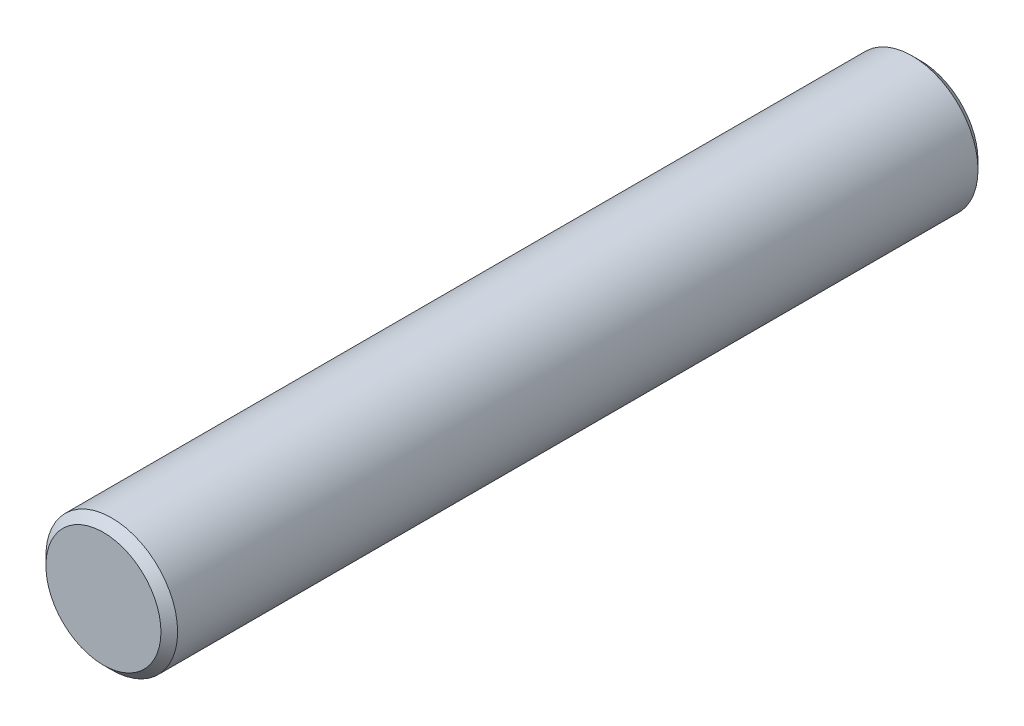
from build123d import *

# Parameters (mm, degrees)
IZIM1_R                     = 3.95
Y_KSEKLIK_EKSTR_ZYON1_DEPTH = 24.5
PAH1_SIZE                   = 0.5


with BuildPart() as part:
    # izim1 → Y_kseklik-Ekstr_zyon1 (new, symmetric)
    with BuildSketch(Plane.XY):
        Circle(IZIM1_R)
    extrude(amount=Y_KSEKLIK_EKSTR_ZYON1_DEPTH, both=True)

    # Pah1
    pah1_edges = [part.edges().sort_by_distance(p)[0] for p in [
        (-3.95, 0, -24.5),
        (-3.95, 0, 24.5),
    ]]
    chamfer(pah1_edges, length=PAH1_SIZE)


solid = part.part
